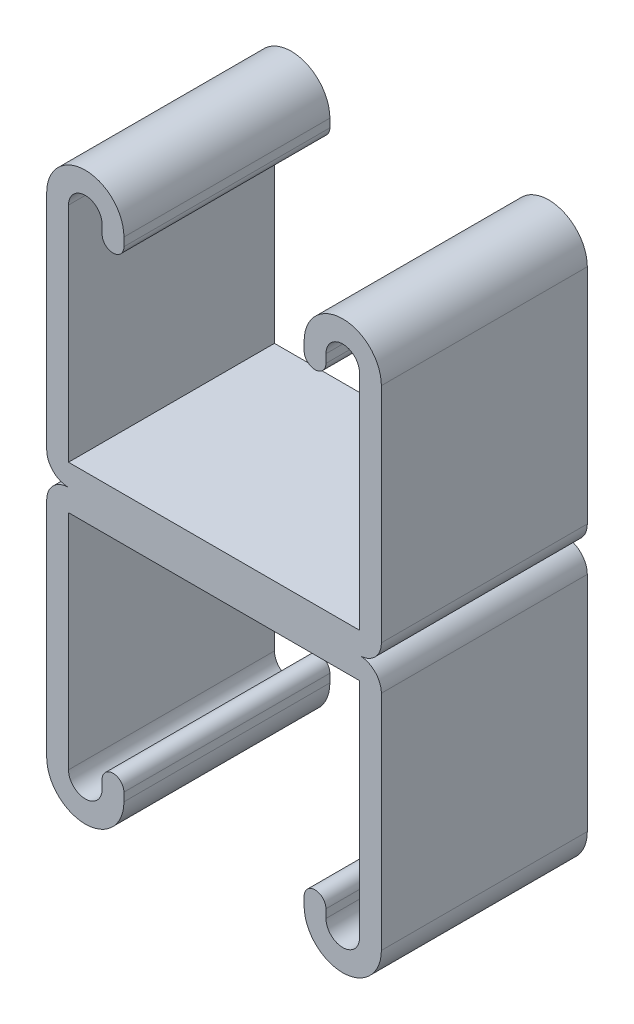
from build123d import *

# Parameters (mm, degrees)
BASE_EXTRUDE_DEPTH = 12.7


with BuildPart() as part:
    # Sketch1 → Base-Extrude (new, symmetric)
    with BuildSketch(Plane.XY):
        with BuildLine():
            Line((-20.6375, 30.1625), (-20.6375, 2.6924))
            ThreePointArc((-20.6375, 2.6924), (-19.848914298, 0.788585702), (-17.9451, 0))
            Line((-17.9451, 0), (17.9451, 0))
            ThreePointArc((17.9451, 0), (19.848914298, 0.788585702), (20.6375, 2.6924))
            Line((20.6375, 2.6924), (20.6375, 30.1625))
            ThreePointArc((20.6375, 30.1625), (15.875, 34.925), (11.1125, 30.1625))
            Line((11.1125, 30.1625), (11.1125, 29.12745))
            ThreePointArc((11.1125, 29.12745), (12.4587, 27.78125), (13.8049, 29.12745))
            Line((13.8049, 29.12745), (13.8049, 30.1625))
            ThreePointArc((13.8049, 30.1625), (15.875, 32.2326), (17.9451, 30.1625))
            Line((17.9451, 30.1625), (17.9451, 2.6924))
            Line((17.9451, 2.6924), (-17.9451, 2.6924))
            Line((-17.9451, 2.6924), (-17.9451, 30.1625))
            ThreePointArc((-17.9451, 30.1625), (-15.875, 32.2326), (-13.8049, 30.1625))
            Line((-13.8049, 30.1625), (-13.8049, 29.12745))
            ThreePointArc((-13.8049, 29.12745), (-12.4587, 27.78125), (-11.1125, 29.12745))
            Line((-11.1125, 29.12745), (-11.1125, 30.1625))
            ThreePointArc((-11.1125, 30.1625), (-15.875, 34.925), (-20.6375, 30.1625))
        make_face()
    base_extrude = extrude(amount=BASE_EXTRUDE_DEPTH, both=True)

    # Mirror1: Base-Extrude across plane
    add(base_extrude.mirror(Plane.ZX))


solid = part.part
